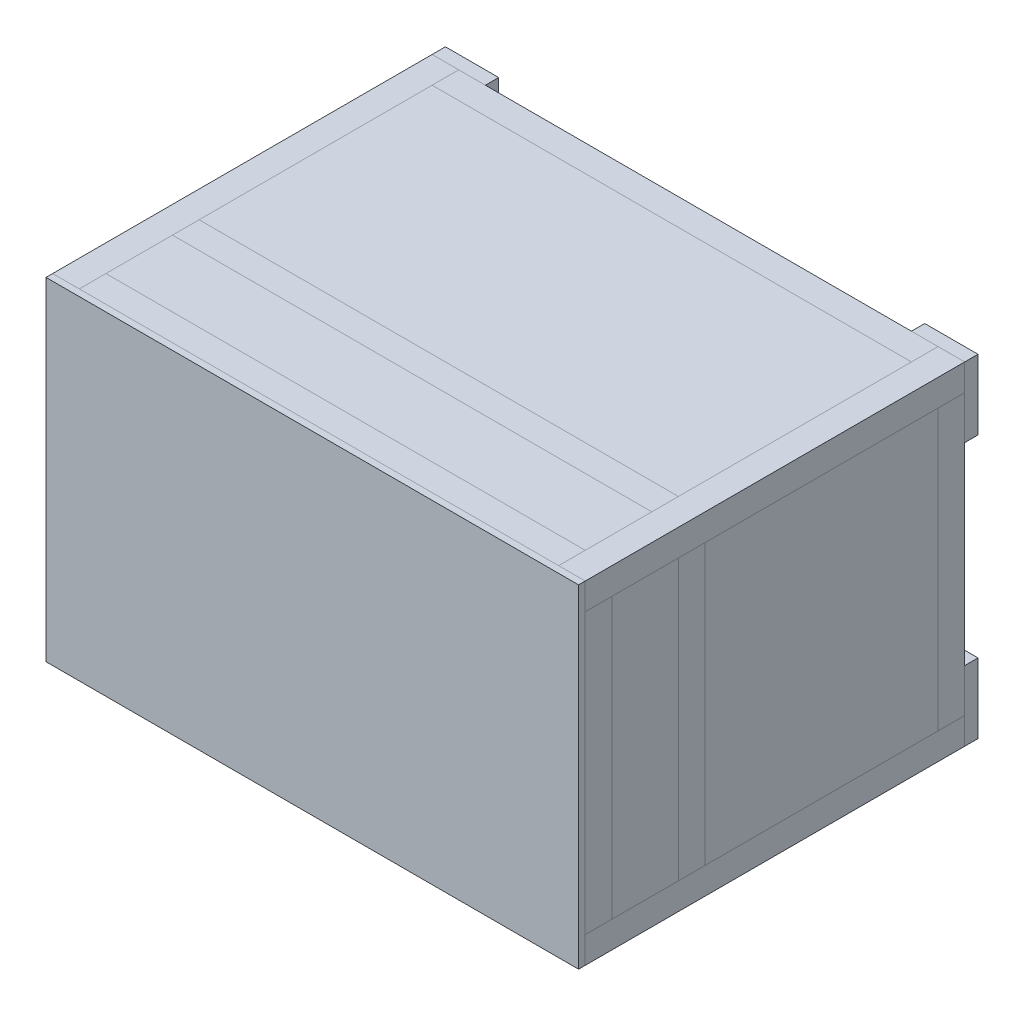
from build123d import *

# Parameters (mm, degrees)
SKETCH_1_W         = 800
SKETCH_1_H         = 500
EXTRUDE_1_DEPTH    = 10
SKETCH_2_W         = 40
SKETCH_2_H         = 40
EXTRUDE_2_DEPTH    = 570
EXTRUDE_2_2_DEPTH  = 570
EXTRUDE_2_3_DEPTH  = 570
EXTRUDE_2_4_DEPTH  = 570
SKETCH_3_W         = 40
SKETCH_3_H         = 40
EXTRUDE_3_DEPTH    = 720
EXTRUDE_3_2_DEPTH  = 720
EXTRUDE_3_3_DEPTH  = 720
EXTRUDE_3_4_DEPTH  = 720
SKETCH_4_W         = 40
SKETCH_4_H         = 40
EXTRUDE_4_DEPTH    = 420
EXTRUDE_4_2_DEPTH  = 420
EXTRUDE_4_3_DEPTH  = 420
EXTRUDE_4_4_DEPTH  = 420
SKETCH_5_W         = 40
SKETCH_5_H         = 40
EXTRUDE_5_DEPTH    = 720
EXTRUDE_5_2_DEPTH  = 720
SKETCH_6_W         = 40
SKETCH_6_H         = 40
EXTRUDE_6_DEPTH    = 420
EXTRUDE_6_2_DEPTH  = 420
SKETCH_7_W         = 350
SKETCH_7_H         = 420
EXTRUDE_7_DEPTH    = 2
SKETCH_7_W_2       = 100
EXTRUDE_7_2_DEPTH  = 2
SKETCH_8_W         = 100
SKETCH_8_H         = 420
EXTRUDE_8_DEPTH    = 2
SKETCH_8_W_2       = 350
EXTRUDE_8_2_DEPTH  = 2
SKETCH_9_W         = 720
SKETCH_9_H         = 350
EXTRUDE_9_DEPTH    = 2
SKETCH_9_H_2       = 100
EXTRUDE_9_2_DEPTH  = 2
SKETCH_10_W        = 100
SKETCH_10_H        = 40
EXTRUDE_10_DEPTH   = 40
SKETCH_11_W        = 80
SKETCH_11_H        = 105
EXTRUDE_14_DEPTH   = 20
EXTRUDE_14_2_DEPTH = 20
EXTRUDE_14_3_DEPTH = 20
EXTRUDE_14_4_DEPTH = 20
SKETCH_14_W        = 270
SKETCH_14_H        = 100
EXTRUDE_15_DEPTH   = 1
SKETCH_14_W_2      = 410
EXTRUDE_15_2_DEPTH = 1
SKETCH_14_W_3      = 359.5
SKETCH_14_H_2      = 350
EXTRUDE_15_3_DEPTH = 1
EXTRUDE_15_4_DEPTH = 1
SKETCH_15_R        = 17.5
EXTRUDE_16_DEPTH   = 15
SKETCH_16_W        = 45
SKETCH_16_H        = 110
SKETCH_16_W_2      = 20
SKETCH_16_H_2      = 95
EXTRUDE_17_DEPTH   = 5
EXTRUDE_17_2_DEPTH = 5
SKETCH_16_W_3      = 110
SKETCH_16_H_3      = 45
SKETCH_16_W_4      = 95
SKETCH_16_H_4      = 20
EXTRUDE_17_3_DEPTH = 5
SKETCH_17_W        = 720
SKETCH_17_H        = 420
EXTRUDE_18_DEPTH   = 1.2
CHAMFER_1_SIZE     = 10
CHAMFER_1_SIZE2    = 3.639702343


with BuildPart() as part:
    # Sketch 1 → Extrude 1 (new body)
    with BuildSketch(Plane.XY):
        Rectangle(SKETCH_1_W, SKETCH_1_H)
    extrude(amount=EXTRUDE_1_DEPTH)


with BuildPart() as body_2:
    # Sketch 2 → Extrude 2 (new body)
    with BuildSketch(Plane(origin=(0, 0, 0), x_dir=(-1, 0, 0), z_dir=(0, 0, -1))):
        with Locations((-380, 230)):
            Rectangle(SKETCH_2_W, SKETCH_2_H)
    extrude(amount=EXTRUDE_2_DEPTH)


with BuildPart() as body_3:
    # Sketch 2 → Extrude 2 2 (new body)
    with BuildSketch(Plane(origin=(0, 0, 0), x_dir=(-1, 0, 0), z_dir=(0, 0, -1))):
        with Locations((380, 230)):
            Rectangle(SKETCH_2_W, SKETCH_2_H)
    extrude(amount=EXTRUDE_2_2_DEPTH)


with BuildPart() as body_4:
    # Sketch 2 → Extrude 2 3 (new body)
    with BuildSketch(Plane(origin=(0, 0, 0), x_dir=(-1, 0, 0), z_dir=(0, 0, -1))):
        with Locations((380, -230)):
            Rectangle(SKETCH_2_W, SKETCH_2_H)
    extrude(amount=EXTRUDE_2_3_DEPTH)


with BuildPart() as body_5:
    # Sketch 2 → Extrude 2 4 (new body)
    with BuildSketch(Plane(origin=(0, 0, 0), x_dir=(-1, 0, 0), z_dir=(0, 0, -1))):
        with Locations((-380, -230)):
            Rectangle(SKETCH_2_W, SKETCH_2_H)
    extrude(amount=EXTRUDE_2_4_DEPTH)


with BuildPart() as body_6:
    # Sketch 3 → Extrude 3 (new body)
    with BuildSketch(Plane(origin=(-360, 0, 0), x_dir=(0, 0, -1), z_dir=(1, 0, 0))):
        with Locations((20, -230)):
            Rectangle(SKETCH_3_W, SKETCH_3_H)
    extrude(amount=EXTRUDE_3_DEPTH)


with BuildPart() as body_7:
    # Sketch 3 → Extrude 3 2 (new body)
    with BuildSketch(Plane(origin=(-360, 0, 0), x_dir=(0, 0, -1), z_dir=(1, 0, 0))):
        with Locations((20, 230)):
            Rectangle(SKETCH_3_W, SKETCH_3_H)
    extrude(amount=EXTRUDE_3_2_DEPTH)


with BuildPart() as body_8:
    # Sketch 3 → Extrude 3 3 (new body)
    with BuildSketch(Plane(origin=(-360, 0, 0), x_dir=(0, 0, -1), z_dir=(1, 0, 0))):
        with Locations((550, -230)):
            Rectangle(SKETCH_3_W, SKETCH_3_H)
    extrude(amount=EXTRUDE_3_3_DEPTH)


with BuildPart() as body_9:
    # Sketch 3 → Extrude 3 4 (new body)
    with BuildSketch(Plane(origin=(-360, 0, 0), x_dir=(0, 0, -1), z_dir=(1, 0, 0))):
        with Locations((550, 230)):
            Rectangle(SKETCH_3_W, SKETCH_3_H)
    extrude(amount=EXTRUDE_3_4_DEPTH)


with BuildPart() as body_10:
    # Sketch 4 → Extrude 4 (new body)
    with BuildSketch(Plane(origin=(0, -210, 0), x_dir=(1, 0, 0), z_dir=(0, 1, 0))):
        with Locations((380, 20)):
            Rectangle(SKETCH_4_W, SKETCH_4_H)
    extrude(amount=EXTRUDE_4_DEPTH)


with BuildPart() as body_11:
    # Sketch 4 → Extrude 4 2 (new body)
    with BuildSketch(Plane(origin=(0, -210, 0), x_dir=(1, 0, 0), z_dir=(0, 1, 0))):
        with Locations((-380, 20)):
            Rectangle(SKETCH_4_W, SKETCH_4_H)
    extrude(amount=EXTRUDE_4_2_DEPTH)


with BuildPart() as body_12:
    # Sketch 4 → Extrude 4 3 (new body)
    with BuildSketch(Plane(origin=(0, -210, 0), x_dir=(1, 0, 0), z_dir=(0, 1, 0))):
        with Locations((380, 550)):
            Rectangle(SKETCH_4_W, SKETCH_4_H)
    extrude(amount=EXTRUDE_4_3_DEPTH)


with BuildPart() as body_13:
    # Sketch 4 → Extrude 4 4 (new body)
    with BuildSketch(Plane(origin=(0, -210, 0), x_dir=(1, 0, 0), z_dir=(0, 1, 0))):
        with Locations((-380, 550)):
            Rectangle(SKETCH_4_W, SKETCH_4_H)
    extrude(amount=EXTRUDE_4_4_DEPTH)


with BuildPart() as body_14:
    # Sketch 5 → Extrude 5 (new body)
    with BuildSketch(Plane.ZY.offset(-360)):
        with Locations((-160, 230)):
            Rectangle(SKETCH_5_W, SKETCH_5_H)
    extrude(amount=EXTRUDE_5_DEPTH)


with BuildPart() as body_15:
    # Sketch 5 → Extrude 5 2 (new body)
    with BuildSketch(Plane.ZY.offset(-360)):
        with Locations((-160, -230)):
            Rectangle(SKETCH_5_W, SKETCH_5_H)
    extrude(amount=EXTRUDE_5_2_DEPTH)


with BuildPart() as body_16:
    # Sketch 6 → Extrude 6 (new body)
    with BuildSketch(Plane(origin=(0, -210, 0), x_dir=(1, 0, 0), z_dir=(0, 1, 0))):
        with Locations((380, 160)):
            Rectangle(SKETCH_6_W, SKETCH_6_H)
    extrude(amount=EXTRUDE_6_DEPTH)


with BuildPart() as body_17:
    # Sketch 6 → Extrude 6 2 (new body)
    with BuildSketch(Plane(origin=(0, -210, 0), x_dir=(1, 0, 0), z_dir=(0, 1, 0))):
        with Locations((-380, 160)):
            Rectangle(SKETCH_6_W, SKETCH_6_H)
    extrude(amount=EXTRUDE_6_2_DEPTH)


with BuildPart() as body_18:
    # Sketch 7 → Extrude 7 (new body)
    with BuildSketch(Plane(origin=(400, 0, 0), x_dir=(0, 0, -1), z_dir=(1, 0, 0))):
        with Locations((355, 0)):
            Rectangle(SKETCH_7_W, SKETCH_7_H)
    extrude(amount=-EXTRUDE_7_DEPTH)


with BuildPart() as body_19:
    # Sketch 7 → Extrude 7 2 (new body)
    with BuildSketch(Plane(origin=(400, 0, 0), x_dir=(0, 0, -1), z_dir=(1, 0, 0))):
        with Locations((90, 0)):
            Rectangle(SKETCH_7_W_2, SKETCH_7_H)
    extrude(amount=-EXTRUDE_7_2_DEPTH)


with BuildPart() as body_20:
    # Sketch 8 → Extrude 8 (new body)
    with BuildSketch(Plane.ZY.offset(400)):
        with Locations((-90, 0)):
            Rectangle(SKETCH_8_W, SKETCH_8_H)
    extrude(amount=-EXTRUDE_8_DEPTH)


with BuildPart() as body_21:
    # Sketch 8 → Extrude 8 2 (new body)
    with BuildSketch(Plane.ZY.offset(400)):
        with Locations((-355, 0)):
            Rectangle(SKETCH_8_W_2, SKETCH_8_H)
    extrude(amount=-EXTRUDE_8_2_DEPTH)


with BuildPart() as body_22:
    # Sketch 9 → Extrude 9 (new body)
    with BuildSketch(Plane(origin=(0, 250, 0), x_dir=(1, 0, 0), z_dir=(0, 1, 0))):
        with Locations((0, 355)):
            Rectangle(SKETCH_9_W, SKETCH_9_H)
    extrude(amount=-EXTRUDE_9_DEPTH)


with BuildPart() as body_23:
    # Sketch 9 → Extrude 9 2 (new body)
    with BuildSketch(Plane(origin=(0, 250, 0), x_dir=(1, 0, 0), z_dir=(0, 1, 0))):
        with Locations((0, 90)):
            Rectangle(SKETCH_9_W, SKETCH_9_H_2)
    extrude(amount=-EXTRUDE_9_2_DEPTH)


with BuildPart() as body_24:
    # Sketch 10 → Extrude 10 (new body)
    with BuildSketch(Plane.ZY.offset(-90)):
        with Locations((-90, -230)):
            Rectangle(SKETCH_10_W, SKETCH_10_H)
    extrude(amount=EXTRUDE_10_DEPTH)


with BuildPart() as body_25:
    # Sketch 11 → Extrude 14 (new body)
    with BuildSketch(Plane(origin=(0, 0, -570), x_dir=(-1, 0, 0), z_dir=(0, 0, -1))):
        with Locations((360, -197.5)):
            Rectangle(SKETCH_11_W, SKETCH_11_H)
    extrude(amount=EXTRUDE_14_DEPTH)


with BuildPart() as body_26:
    # Sketch 11 → Extrude 14 2 (new body)
    with BuildSketch(Plane(origin=(0, 0, -570), x_dir=(-1, 0, 0), z_dir=(0, 0, -1))):
        with Locations((-360, -197.5)):
            Rectangle(SKETCH_11_W, SKETCH_11_H)
    extrude(amount=EXTRUDE_14_2_DEPTH)


with BuildPart() as body_27:
    # Sketch 11 → Extrude 14 3 (new body)
    with BuildSketch(Plane(origin=(0, 0, -570), x_dir=(-1, 0, 0), z_dir=(0, 0, -1))):
        with Locations((360, 197.5)):
            Rectangle(SKETCH_11_W, SKETCH_11_H)
    extrude(amount=EXTRUDE_14_3_DEPTH)


with BuildPart() as body_28:
    # Sketch 11 → Extrude 14 4 (new body)
    with BuildSketch(Plane(origin=(0, 0, -570), x_dir=(-1, 0, 0), z_dir=(0, 0, -1))):
        with Locations((-360, 197.5)):
            Rectangle(SKETCH_11_W, SKETCH_11_H)
    extrude(amount=EXTRUDE_14_4_DEPTH)


with BuildPart() as body_29:
    # Sketch 14 → Extrude 15 (new body)
    with BuildSketch(Plane.XZ.offset(250)):
        with Locations((225, -90)):
            Rectangle(SKETCH_14_W, SKETCH_14_H)
    extrude(amount=-EXTRUDE_15_DEPTH)


with BuildPart() as body_30:
    # Sketch 14 → Extrude 15 2 (new body)
    with BuildSketch(Plane.XZ.offset(250)):
        with Locations((-155, -90)):
            Rectangle(SKETCH_14_W_2, SKETCH_14_H)
    extrude(amount=-EXTRUDE_15_2_DEPTH)


with BuildPart() as body_31:
    # Sketch 14 → Extrude 15 3 (new body)
    with BuildSketch(Plane.XZ.offset(250)):
        with Locations((-180.25, -355)):
            Rectangle(SKETCH_14_W_3, SKETCH_14_H_2)
    extrude(amount=-EXTRUDE_15_3_DEPTH)


with BuildPart() as body_32:
    # Sketch 14 → Extrude 15 4 (new body)
    with BuildSketch(Plane.XZ.offset(250)):
        with Locations((180.25, -355)):
            Rectangle(SKETCH_14_W_3, SKETCH_14_H_2)
    extrude(amount=-EXTRUDE_15_4_DEPTH)


with BuildPart() as body_33:
    # Sketch 15 → Extrude 16 (new body)
    with BuildSketch(Plane.XZ.offset(250)):
        with Locations(Location((320, -75, 0), (0, 0, 270))):
            Circle(SKETCH_15_R)
    extrude(amount=EXTRUDE_16_DEPTH)

    # Chamfer 1
    chamfer_1_edges = [body_33.edges().sort_by_distance(p)[0] for p in [
        (320, -265, -57.5),
    ]]
    chamfer_1_side = [body_33.faces().sort_by_distance(p)[0] for p in [
        (320, -257.5, -57.5),
    ]]
    chamfer(chamfer_1_edges, length=CHAMFER_1_SIZE, length2=CHAMFER_1_SIZE2, reference=chamfer_1_side[0])


with BuildPart() as body_34:
    # Sketch 16 → Extrude 17 (new body)
    with BuildSketch(Plane.XZ.offset(250)):
        with Locations((43, -355)):
            Rectangle(SKETCH_16_W, SKETCH_16_H)
        with Locations((45.5, -355)):
            Rectangle(SKETCH_16_W_2, SKETCH_16_H_2, mode=Mode.SUBTRACT)
    extrude(amount=EXTRUDE_17_DEPTH)


with BuildPart() as body_35:
    # Sketch 16 → Extrude 17 2 (new body)
    with BuildSketch(Plane.XZ.offset(250)):
        with Locations((-43, -355)):
            Rectangle(SKETCH_16_W, SKETCH_16_H)
        with Locations((-45.5, -355)):
            Rectangle(SKETCH_16_W_2, SKETCH_16_H_2, mode=Mode.SUBTRACT)
    extrude(amount=EXTRUDE_17_2_DEPTH)


with BuildPart() as body_36:
    # Sketch 16 → Extrude 17 3 (new body)
    with BuildSketch(Plane.XZ.offset(250)):
        with Locations((-155, -82.5)):
            Rectangle(SKETCH_16_W_3, SKETCH_16_H_3)
        with Locations((-155, -85)):
            Rectangle(SKETCH_16_W_4, SKETCH_16_H_4, mode=Mode.SUBTRACT)
    extrude(amount=EXTRUDE_17_3_DEPTH)


with BuildPart() as body_37:
    # Sketch 17 → Extrude 18 (new body)
    with BuildSketch(Plane(origin=(0, 0, -570), x_dir=(-1, 0, 0), z_dir=(0, 0, -1))):
        Rectangle(SKETCH_17_W, SKETCH_17_H)
    extrude(amount=-EXTRUDE_18_DEPTH)


solid = Compound([part.part, body_2.part, body_3.part, body_4.part, body_5.part, body_6.part, body_7.part, body_8.part, body_9.part, body_10.part, body_11.part, body_12.part, body_13.part, body_14.part, body_15.part, body_16.part, body_17.part, body_18.part, body_19.part, body_20.part, body_21.part, body_22.part, body_23.part, body_24.part, body_25.part, body_26.part, body_27.part, body_28.part, body_29.part, body_30.part, body_31.part, body_32.part, body_33.part, body_34.part, body_35.part, body_36.part, body_37.part])
